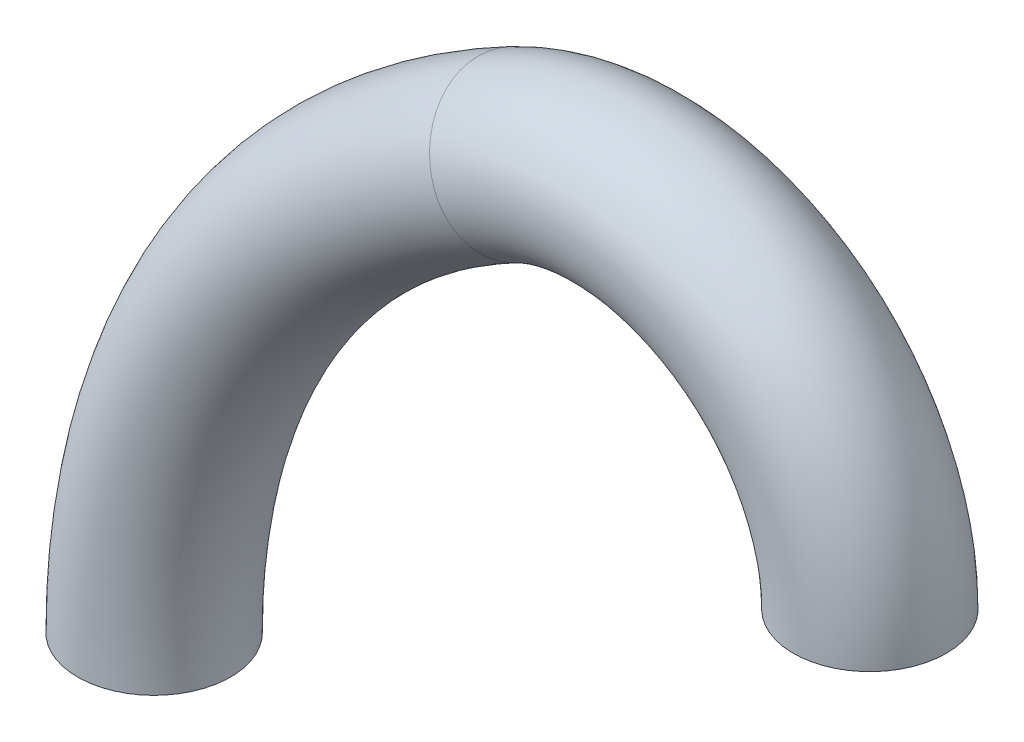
from build123d import *

# Parameters (mm, degrees)
SKETCH2_R = 3.96875


with BuildPart() as part:
    # Sweep1: sweep along a path in Sketch1
    with BuildLine(Plane.XY) as sweep1_path:
        ThreePointArc((0, 0), (5.026784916, 18.004484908), (18.653118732, 30.80108876))
        ThreePointArc((18.653118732, 30.80108876), (31.033051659, 30.41233557), (37.113490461, 19.6215))
    # Sketch2 → Sweep1 (sweep)
    with BuildSketch(Plane(origin=(0, 0, 0), x_dir=(1, 0, 0), z_dir=(0, 1, 0))):
        Circle(SKETCH2_R)
    sweep(path=sweep1_path.line)


solid = part.part
